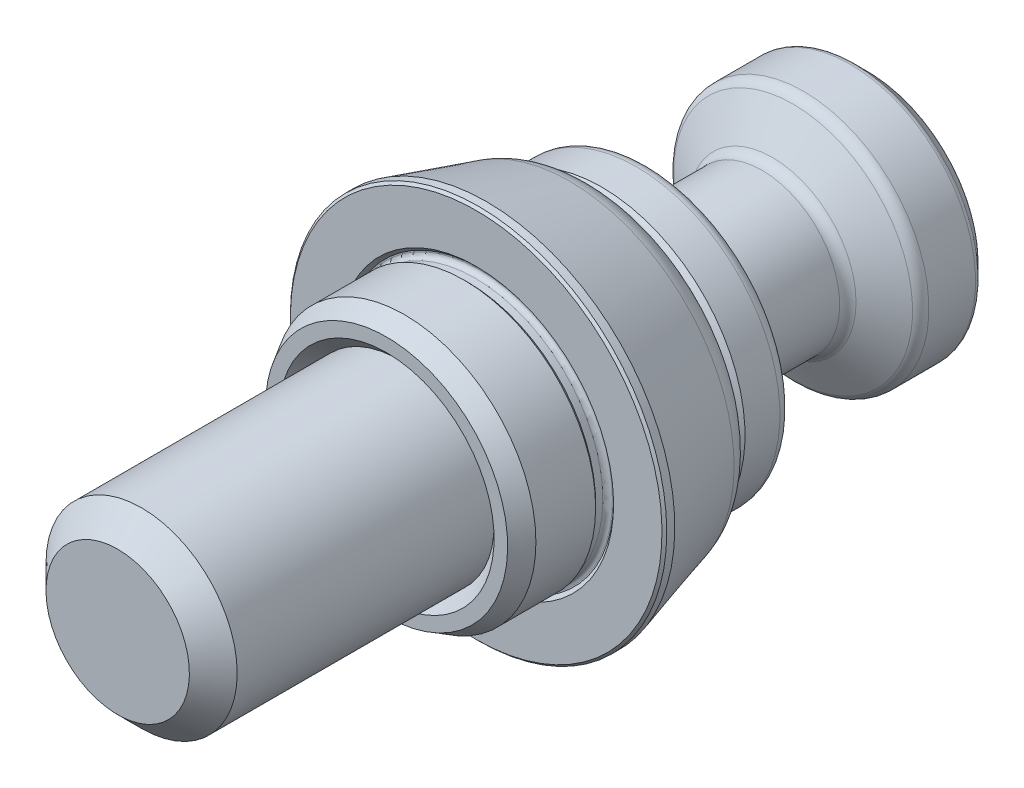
ISO-10303-21;
HEADER;
FILE_DESCRIPTION(('STEP AP214'),'2;1');
FILE_NAME('part.step','',(''),(''),'','','');
FILE_SCHEMA(('AUTOMOTIVE_DESIGN { 1 0 10303 214 1 1 1 1 }'));
ENDSEC;
DATA;
#1=APPLICATION_CONTEXT('core data for automotive mechanical design processes');
#2=APPLICATION_PROTOCOL_DEFINITION('international standard','automotive_design',2000,#1);
#3=PRODUCT_CONTEXT('',#1,'mechanical');
#4=PRODUCT('Part','Part','',(#3));
#5=PRODUCT_RELATED_PRODUCT_CATEGORY('part','',(#4));
#6=PRODUCT_DEFINITION_FORMATION('','',#4);
#7=PRODUCT_DEFINITION_CONTEXT('part definition',#1,'design');
#8=PRODUCT_DEFINITION('design','',#6,#7);
#9=PRODUCT_DEFINITION_SHAPE('','',#8);
#10=(LENGTH_UNIT() NAMED_UNIT(*) SI_UNIT(.MILLI.,.METRE.));
#11=(NAMED_UNIT(*) PLANE_ANGLE_UNIT() SI_UNIT($,.RADIAN.));
#12=(NAMED_UNIT(*) SI_UNIT($,.STERADIAN.) SOLID_ANGLE_UNIT());
#13=UNCERTAINTY_MEASURE_WITH_UNIT(LENGTH_MEASURE(1.E-05),#10,'distance_accuracy_value','');
#14=(GEOMETRIC_REPRESENTATION_CONTEXT(3) GLOBAL_UNCERTAINTY_ASSIGNED_CONTEXT((#13)) GLOBAL_UNIT_ASSIGNED_CONTEXT((#10,
#11,#12)) REPRESENTATION_CONTEXT('',''));
#15=CARTESIAN_POINT('',(0.,0.,0.));
#16=DIRECTION('',(0.,0.,1.));
#17=DIRECTION('',(1.,0.,0.));
#18=AXIS2_PLACEMENT_3D('',#15,#16,#17);
#19=CARTESIAN_POINT('',(0.,0.,7.5));
#20=DIRECTION('',(0.,0.,1.));
#21=DIRECTION('',(0.,-1.,0.));
#22=AXIS2_PLACEMENT_3D('',#19,#20,#21);
#23=CONICAL_SURFACE('',#22,9.,0.785398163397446);
#24=CARTESIAN_POINT('',(0.,0.,6.5));
#25=DIRECTION('',(0.,0.,1.));
#26=DIRECTION('',(0.,-1.,0.));
#27=AXIS2_PLACEMENT_3D('',#24,#25,#26);
#28=CIRCLE('',#27,8.);
#29=CARTESIAN_POINT('',(0.,-8.,6.5));
#30=VERTEX_POINT('',#29);
#31=EDGE_CURVE('E23',#30,#30,#28,.F.);
#32=ORIENTED_EDGE('',*,*,#31,.T.);
#33=EDGE_LOOP('',(#32));
#34=FACE_BOUND('',#33,.T.);
#35=CARTESIAN_POINT('',(0.,0.,7.5));
#36=DIRECTION('',(0.,0.,1.));
#37=DIRECTION('',(0.,-1.,0.));
#38=AXIS2_PLACEMENT_3D('',#35,#36,#37);
#39=CIRCLE('',#38,9.);
#40=CARTESIAN_POINT('',(0.,-9.,7.5));
#41=VERTEX_POINT('',#40);
#42=EDGE_CURVE('E178',#41,#41,#39,.F.);
#43=ORIENTED_EDGE('',*,*,#42,.F.);
#44=EDGE_LOOP('',(#43));
#45=FACE_BOUND('',#44,.T.);
#46=ADVANCED_FACE('F14',(#34,#45),#23,.F.);
#47=CARTESIAN_POINT('',(8.,0.,7.5));
#48=DIRECTION('',(0.,0.,1.));
#49=DIRECTION('',(0.,-1.,0.));
#50=AXIS2_PLACEMENT_3D('',#47,#48,#49);
#51=PLANE('',#50);
#52=ORIENTED_EDGE('',*,*,#42,.T.);
#53=EDGE_LOOP('',(#52));
#54=FACE_BOUND('',#53,.T.);
#55=CARTESIAN_POINT('',(0.,0.,7.5));
#56=DIRECTION('',(0.,0.,1.));
#57=DIRECTION('',(0.,-1.,0.));
#58=AXIS2_PLACEMENT_3D('',#55,#56,#57);
#59=CIRCLE('',#58,10.1339745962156);
#60=CARTESIAN_POINT('',(0.,-10.1339745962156,7.5));
#61=VERTEX_POINT('',#60);
#62=EDGE_CURVE('E175',#61,#61,#59,.T.);
#63=ORIENTED_EDGE('',*,*,#62,.T.);
#64=EDGE_LOOP('',(#63));
#65=FACE_BOUND('',#64,.T.);
#66=ADVANCED_FACE('F281',(#54,#65),#51,.T.);
#67=CARTESIAN_POINT('',(0.,0.,6.));
#68=DIRECTION('',(0.,0.,-1.));
#69=DIRECTION('',(0.,1.,0.));
#70=AXIS2_PLACEMENT_3D('',#67,#68,#69);
#71=CONICAL_SURFACE('',#70,11.,0.523598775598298);
#72=ORIENTED_EDGE('',*,*,#62,.F.);
#73=EDGE_LOOP('',(#72));
#74=FACE_BOUND('',#73,.T.);
#75=CARTESIAN_POINT('',(0.,0.,6.));
#76=DIRECTION('',(0.,0.,1.));
#77=DIRECTION('',(0.,-1.,0.));
#78=AXIS2_PLACEMENT_3D('',#75,#76,#77);
#79=CIRCLE('',#78,11.);
#80=CARTESIAN_POINT('',(0.,-11.,6.));
#81=VERTEX_POINT('',#80);
#82=EDGE_CURVE('E172',#81,#81,#79,.F.);
#83=ORIENTED_EDGE('',*,*,#82,.F.);
#84=EDGE_LOOP('',(#83));
#85=FACE_BOUND('',#84,.T.);
#86=ADVANCED_FACE('F282',(#74,#85),#71,.T.);
#87=CARTESIAN_POINT('',(0.,0.,0.));
#88=DIRECTION('',(0.,0.,-1.));
#89=DIRECTION('',(0.,1.,0.));
#90=AXIS2_PLACEMENT_3D('',#87,#88,#89);
#91=CYLINDRICAL_SURFACE('',#90,11.);
#92=CARTESIAN_POINT('',(0.,0.,1.));
#93=DIRECTION('',(0.,0.,-1.));
#94=DIRECTION('',(0.,1.,0.));
#95=AXIS2_PLACEMENT_3D('',#92,#93,#94);
#96=CIRCLE('',#95,11.);
#97=CARTESIAN_POINT('',(0.,11.,1.));
#98=VERTEX_POINT('',#97);
#99=EDGE_CURVE('E154',#98,#98,#96,.T.);
#100=ORIENTED_EDGE('',*,*,#99,.F.);
#101=EDGE_LOOP('',(#100));
#102=FACE_BOUND('',#101,.T.);
#103=ORIENTED_EDGE('',*,*,#82,.T.);
#104=EDGE_LOOP('',(#103));
#105=FACE_BOUND('',#104,.T.);
#106=ADVANCED_FACE('F287',(#102,#105),#91,.T.);
#107=CARTESIAN_POINT('',(0.,0.,1.));
#108=DIRECTION('',(0.,0.,1.));
#109=DIRECTION('',(0.,-1.,0.));
#110=AXIS2_PLACEMENT_3D('',#107,#108,#109);
#111=CONICAL_SURFACE('',#110,11.,0.78539816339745);
#112=CARTESIAN_POINT('',(0.,0.,0.7));
#113=DIRECTION('',(0.,0.,-1.));
#114=DIRECTION('',(0.,1.,0.));
#115=AXIS2_PLACEMENT_3D('',#112,#113,#114);
#116=CIRCLE('',#115,10.7);
#117=CARTESIAN_POINT('',(0.,10.7,0.7));
#118=VERTEX_POINT('',#117);
#119=EDGE_CURVE('E157',#118,#118,#116,.T.);
#120=ORIENTED_EDGE('',*,*,#119,.F.);
#121=EDGE_LOOP('',(#120));
#122=FACE_BOUND('',#121,.T.);
#123=ORIENTED_EDGE('',*,*,#99,.T.);
#124=EDGE_LOOP('',(#123));
#125=FACE_BOUND('',#124,.T.);
#126=ADVANCED_FACE('F272',(#122,#125),#111,.T.);
#127=CARTESIAN_POINT('',(0.,0.,0.));
#128=DIRECTION('',(0.,0.,-1.));
#129=DIRECTION('',(0.,1.,0.));
#130=AXIS2_PLACEMENT_3D('',#127,#128,#129);
#131=CYLINDRICAL_SURFACE('',#130,10.7);
#132=CARTESIAN_POINT('',(0.,0.,0.1));
#133=DIRECTION('',(0.,0.,-1.));
#134=DIRECTION('',(0.,1.,0.));
#135=AXIS2_PLACEMENT_3D('',#132,#133,#134);
#136=CIRCLE('',#135,10.7);
#137=CARTESIAN_POINT('',(0.,10.7,0.1));
#138=VERTEX_POINT('',#137);
#139=EDGE_CURVE('E18',#138,#138,#136,.F.);
#140=ORIENTED_EDGE('',*,*,#139,.T.);
#141=EDGE_LOOP('',(#140));
#142=FACE_BOUND('',#141,.T.);
#143=ORIENTED_EDGE('',*,*,#119,.T.);
#144=EDGE_LOOP('',(#143));
#145=FACE_BOUND('',#144,.T.);
#146=ADVANCED_FACE('F270',(#142,#145),#131,.T.);
#147=CARTESIAN_POINT('',(0.,0.,0.1));
#148=DIRECTION('',(0.,0.,-1.));
#149=DIRECTION('',(0.,1.,0.));
#150=AXIS2_PLACEMENT_3D('',#147,#148,#149);
#151=TOROIDAL_SURFACE('',#150,11.1,0.4);
#152=ORIENTED_EDGE('',*,*,#139,.F.);
#153=EDGE_LOOP('',(#152));
#154=FACE_BOUND('',#153,.T.);
#155=CARTESIAN_POINT('',(0.,0.,-0.3));
#156=DIRECTION('',(0.,0.,-1.));
#157=DIRECTION('',(0.,1.,0.));
#158=AXIS2_PLACEMENT_3D('',#155,#156,#157);
#159=CIRCLE('',#158,11.1);
#160=CARTESIAN_POINT('',(0.,11.1,-0.3));
#161=VERTEX_POINT('',#160);
#162=EDGE_CURVE('E186',#161,#161,#159,.T.);
#163=ORIENTED_EDGE('',*,*,#162,.F.);
#164=EDGE_LOOP('',(#163));
#165=FACE_BOUND('',#164,.T.);
#166=ADVANCED_FACE('F16',(#154,#165),#151,.F.);
#167=CARTESIAN_POINT('',(0.,0.,-7.));
#168=DIRECTION('',(0.,0.,-1.));
#169=DIRECTION('',(0.,1.,0.));
#170=AXIS2_PLACEMENT_3D('',#167,#168,#169);
#171=TOROIDAL_SURFACE('',#170,10.8718839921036,3.);
#172=CARTESIAN_POINT('',(0.,0.,-7.82691206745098));
#173=DIRECTION('',(0.,0.,-1.));
#174=DIRECTION('',(0.,1.,0.));
#175=AXIS2_PLACEMENT_3D('',#172,#173,#174);
#176=CIRCLE('',#175,13.7556690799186);
#177=CARTESIAN_POINT('',(0.,13.7556690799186,-7.82691206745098));
#178=VERTEX_POINT('',#177);
#179=EDGE_CURVE('E169',#178,#178,#176,.F.);
#180=ORIENTED_EDGE('',*,*,#179,.F.);
#181=EDGE_LOOP('',(#180));
#182=FACE_BOUND('',#181,.T.);
#183=CARTESIAN_POINT('',(0.,0.,-10.));
#184=DIRECTION('',(0.,0.,-1.));
#185=DIRECTION('',(0.,1.,0.));
#186=AXIS2_PLACEMENT_3D('',#183,#184,#185);
#187=CIRCLE('',#186,10.8718839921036);
#188=CARTESIAN_POINT('',(0.,10.8718839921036,-10.));
#189=VERTEX_POINT('',#188);
#190=EDGE_CURVE('E9',#189,#189,#187,.T.);
#191=ORIENTED_EDGE('',*,*,#190,.F.);
#192=EDGE_LOOP('',(#191));
#193=FACE_BOUND('',#192,.T.);
#194=ADVANCED_FACE('F269',(#182,#193),#171,.T.);
#195=CARTESIAN_POINT('',(0.,0.,-10.));
#196=DIRECTION('',(0.,0.,1.));
#197=DIRECTION('',(0.,-1.,0.));
#198=AXIS2_PLACEMENT_3D('',#195,#196,#197);
#199=CONICAL_SURFACE('',#198,13.132546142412,0.279252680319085);
#200=ORIENTED_EDGE('',*,*,#179,.T.);
#201=EDGE_LOOP('',(#200));
#202=FACE_BOUND('',#201,.T.);
#203=CARTESIAN_POINT('',(0.,0.,-0.871853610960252));
#204=DIRECTION('',(0.,0.,-1.));
#205=DIRECTION('',(0.,1.,0.));
#206=AXIS2_PLACEMENT_3D('',#203,#204,#205);
#207=CIRCLE('',#206,15.75);
#208=CARTESIAN_POINT('',(0.,15.75,-0.871853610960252));
#209=VERTEX_POINT('',#208);
#210=EDGE_CURVE('E166',#209,#209,#207,.T.);
#211=ORIENTED_EDGE('',*,*,#210,.T.);
#212=EDGE_LOOP('',(#211));
#213=FACE_BOUND('',#212,.T.);
#214=ADVANCED_FACE('F278',(#202,#213),#199,.T.);
#215=CARTESIAN_POINT('',(0.,0.,0.));
#216=DIRECTION('',(0.,0.,-1.));
#217=DIRECTION('',(0.,1.,0.));
#218=AXIS2_PLACEMENT_3D('',#215,#216,#217);
#219=CYLINDRICAL_SURFACE('',#218,15.75);
#220=CARTESIAN_POINT('',(0.,0.,-0.199999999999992));
#221=DIRECTION('',(0.,0.,1.));
#222=DIRECTION('',(0.,-1.,0.));
#223=AXIS2_PLACEMENT_3D('',#220,#221,#222);
#224=CIRCLE('',#223,15.75);
#225=CARTESIAN_POINT('',(0.,-15.75,-0.199999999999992));
#226=VERTEX_POINT('',#225);
#227=EDGE_CURVE('E181',#226,#226,#224,.F.);
#228=ORIENTED_EDGE('',*,*,#227,.T.);
#229=EDGE_LOOP('',(#228));
#230=FACE_BOUND('',#229,.T.);
#231=ORIENTED_EDGE('',*,*,#210,.F.);
#232=EDGE_LOOP('',(#231));
#233=FACE_BOUND('',#232,.T.);
#234=ADVANCED_FACE('F315',(#230,#233),#219,.T.);
#235=CARTESIAN_POINT('',(0.,0.,-0.199999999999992));
#236=DIRECTION('',(0.,0.,-1.));
#237=DIRECTION('',(0.,1.,0.));
#238=AXIS2_PLACEMENT_3D('',#235,#236,#237);
#239=CONICAL_SURFACE('',#238,15.75,0.785398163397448);
#240=CARTESIAN_POINT('',(0.,0.,0.));
#241=DIRECTION('',(0.,0.,1.));
#242=DIRECTION('',(0.,-1.,0.));
#243=AXIS2_PLACEMENT_3D('',#240,#241,#242);
#244=CIRCLE('',#243,15.55);
#245=CARTESIAN_POINT('',(0.,-15.55,0.));
#246=VERTEX_POINT('',#245);
#247=EDGE_CURVE('E184',#246,#246,#244,.T.);
#248=ORIENTED_EDGE('',*,*,#247,.F.);
#249=EDGE_LOOP('',(#248));
#250=FACE_BOUND('',#249,.T.);
#251=ORIENTED_EDGE('',*,*,#227,.F.);
#252=EDGE_LOOP('',(#251));
#253=FACE_BOUND('',#252,.T.);
#254=ADVANCED_FACE('F309',(#250,#253),#239,.T.);
#255=CARTESIAN_POINT('',(11.,0.,0.));
#256=DIRECTION('',(0.,0.,1.));
#257=DIRECTION('',(0.,-1.,0.));
#258=AXIS2_PLACEMENT_3D('',#255,#256,#257);
#259=PLANE('',#258);
#260=CARTESIAN_POINT('',(0.,0.,0.));
#261=DIRECTION('',(0.,0.,-1.));
#262=DIRECTION('',(0.,1.,0.));
#263=AXIS2_PLACEMENT_3D('',#260,#261,#262);
#264=CIRCLE('',#263,11.5);
#265=CARTESIAN_POINT('',(0.,11.5,0.));
#266=VERTEX_POINT('',#265);
#267=EDGE_CURVE('E163',#266,#266,#264,.T.);
#268=ORIENTED_EDGE('',*,*,#267,.T.);
#269=EDGE_LOOP('',(#268));
#270=FACE_BOUND('',#269,.T.);
#271=ORIENTED_EDGE('',*,*,#247,.T.);
#272=EDGE_LOOP('',(#271));
#273=FACE_BOUND('',#272,.T.);
#274=ADVANCED_FACE('F297',(#270,#273),#259,.T.);
#275=CARTESIAN_POINT('',(0.,0.,-0.3));
#276=DIRECTION('',(0.,0.,1.));
#277=DIRECTION('',(0.,-1.,0.));
#278=AXIS2_PLACEMENT_3D('',#275,#276,#277);
#279=CONICAL_SURFACE('',#278,11.2,0.785398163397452);
#280=ORIENTED_EDGE('',*,*,#267,.F.);
#281=EDGE_LOOP('',(#280));
#282=FACE_BOUND('',#281,.T.);
#283=CARTESIAN_POINT('',(0.,0.,-0.3));
#284=DIRECTION('',(0.,0.,-1.));
#285=DIRECTION('',(0.,1.,0.));
#286=AXIS2_PLACEMENT_3D('',#283,#284,#285);
#287=CIRCLE('',#286,11.2);
#288=CARTESIAN_POINT('',(0.,11.2,-0.3));
#289=VERTEX_POINT('',#288);
#290=EDGE_CURVE('E160',#289,#289,#287,.T.);
#291=ORIENTED_EDGE('',*,*,#290,.T.);
#292=EDGE_LOOP('',(#291));
#293=FACE_BOUND('',#292,.T.);
#294=ADVANCED_FACE('F305',(#282,#293),#279,.F.);
#295=CARTESIAN_POINT('',(10.7,0.,-0.3));
#296=DIRECTION('',(0.,0.,-1.));
#297=DIRECTION('',(0.,1.,0.));
#298=AXIS2_PLACEMENT_3D('',#295,#296,#297);
#299=PLANE('',#298);
#300=ORIENTED_EDGE('',*,*,#162,.T.);
#301=EDGE_LOOP('',(#300));
#302=FACE_BOUND('',#301,.T.);
#303=ORIENTED_EDGE('',*,*,#290,.F.);
#304=EDGE_LOOP('',(#303));
#305=FACE_BOUND('',#304,.T.);
#306=ADVANCED_FACE('F284',(#302,#305),#299,.F.);
#307=CARTESIAN_POINT('',(0.,0.,-10.));
#308=DIRECTION('',(0.,0.,-1.));
#309=DIRECTION('',(0.,-1.,0.));
#310=AXIS2_PLACEMENT_3D('',#307,#308,#309);
#311=CYLINDRICAL_SURFACE('',#310,8.);
#312=ORIENTED_EDGE('',*,*,#31,.F.);
#313=EDGE_LOOP('',(#312));
#314=FACE_BOUND('',#313,.T.);
#315=CARTESIAN_POINT('',(0.,0.,28.));
#316=DIRECTION('',(0.,0.,1.));
#317=DIRECTION('',(0.,1.,0.));
#318=AXIS2_PLACEMENT_3D('',#315,#316,#317);
#319=CIRCLE('',#318,8.);
#320=CARTESIAN_POINT('',(0.,8.,28.));
#321=VERTEX_POINT('',#320);
#322=EDGE_CURVE('E128',#321,#321,#319,.F.);
#323=ORIENTED_EDGE('',*,*,#322,.T.);
#324=EDGE_LOOP('',(#323));
#325=FACE_BOUND('',#324,.T.);
#326=ADVANCED_FACE('F304',(#314,#325),#311,.T.);
#327=CARTESIAN_POINT('',(0.,0.,28.));
#328=DIRECTION('',(0.,0.,-1.));
#329=DIRECTION('',(0.,-1.,0.));
#330=AXIS2_PLACEMENT_3D('',#327,#328,#329);
#331=CONICAL_SURFACE('',#330,8.,0.78539816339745);
#332=CARTESIAN_POINT('',(0.,0.,30.));
#333=DIRECTION('',(0.,0.,1.));
#334=DIRECTION('',(0.,1.,0.));
#335=AXIS2_PLACEMENT_3D('',#332,#333,#334);
#336=CIRCLE('',#335,6.);
#337=CARTESIAN_POINT('',(0.,6.,30.));
#338=VERTEX_POINT('',#337);
#339=EDGE_CURVE('E131',#338,#338,#336,.T.);
#340=ORIENTED_EDGE('',*,*,#339,.F.);
#341=EDGE_LOOP('',(#340));
#342=FACE_BOUND('',#341,.T.);
#343=ORIENTED_EDGE('',*,*,#322,.F.);
#344=EDGE_LOOP('',(#343));
#345=FACE_BOUND('',#344,.T.);
#346=ADVANCED_FACE('F372',(#342,#345),#331,.T.);
#347=CARTESIAN_POINT('',(0.,0.,30.));
#348=DIRECTION('',(0.,0.,1.));
#349=DIRECTION('',(0.,1.,0.));
#350=AXIS2_PLACEMENT_3D('',#347,#348,#349);
#351=PLANE('',#350);
#352=ORIENTED_EDGE('',*,*,#339,.T.);
#353=EDGE_LOOP('',(#352));
#354=FACE_BOUND('',#353,.T.);
#355=ADVANCED_FACE('F296',(#354),#351,.T.);
#356=CARTESIAN_POINT('',(0.,0.,-27.3867513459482));
#357=DIRECTION('',(0.,0.,-1.));
#358=DIRECTION('',(0.,-1.,0.));
#359=AXIS2_PLACEMENT_3D('',#356,#357,#358);
#360=TOROIDAL_SURFACE('',#359,9.5,1.);
#361=CARTESIAN_POINT('',(0.,0.,-27.3867513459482));
#362=DIRECTION('',(0.,0.,-1.));
#363=DIRECTION('',(0.,-1.,0.));
#364=AXIS2_PLACEMENT_3D('',#361,#362,#363);
#365=CIRCLE('',#364,10.5);
#366=CARTESIAN_POINT('',(0.,-10.5,-27.3867513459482));
#367=VERTEX_POINT('',#366);
#368=EDGE_CURVE('E149',#367,#367,#365,.T.);
#369=ORIENTED_EDGE('',*,*,#368,.F.);
#370=EDGE_LOOP('',(#369));
#371=FACE_BOUND('',#370,.T.);
#372=CARTESIAN_POINT('',(0.,0.,-26.5207259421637));
#373=DIRECTION('',(0.,0.,1.));
#374=DIRECTION('',(0.,1.,0.));
#375=AXIS2_PLACEMENT_3D('',#372,#373,#374);
#376=CIRCLE('',#375,10.);
#377=CARTESIAN_POINT('',(0.,10.,-26.5207259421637));
#378=VERTEX_POINT('',#377);
#379=EDGE_CURVE('E146',#378,#378,#376,.T.);
#380=ORIENTED_EDGE('',*,*,#379,.F.);
#381=EDGE_LOOP('',(#380));
#382=FACE_BOUND('',#381,.T.);
#383=ADVANCED_FACE('F265',(#371,#382),#360,.T.);
#384=CARTESIAN_POINT('',(0.,0.,-13.4226497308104));
#385=DIRECTION('',(0.,0.,-1.));
#386=DIRECTION('',(0.,-1.,0.));
#387=AXIS2_PLACEMENT_3D('',#384,#385,#386);
#388=TOROIDAL_SURFACE('',#387,11.,1.);
#389=CARTESIAN_POINT('',(0.,0.,-14.2886751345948));
#390=DIRECTION('',(0.,0.,-1.));
#391=DIRECTION('',(0.,-1.,0.));
#392=AXIS2_PLACEMENT_3D('',#389,#390,#391);
#393=CIRCLE('',#392,11.5);
#394=CARTESIAN_POINT('',(0.,-11.5,-14.2886751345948));
#395=VERTEX_POINT('',#394);
#396=EDGE_CURVE('E143',#395,#395,#393,.T.);
#397=ORIENTED_EDGE('',*,*,#396,.F.);
#398=EDGE_LOOP('',(#397));
#399=FACE_BOUND('',#398,.T.);
#400=CARTESIAN_POINT('',(0.,0.,-13.4226497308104));
#401=DIRECTION('',(0.,0.,-1.));
#402=DIRECTION('',(0.,-1.,0.));
#403=AXIS2_PLACEMENT_3D('',#400,#401,#402);
#404=CIRCLE('',#403,12.);
#405=CARTESIAN_POINT('',(0.,-12.,-13.4226497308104));
#406=VERTEX_POINT('',#405);
#407=EDGE_CURVE('E140',#406,#406,#404,.F.);
#408=ORIENTED_EDGE('',*,*,#407,.F.);
#409=EDGE_LOOP('',(#408));
#410=FACE_BOUND('',#409,.T.);
#411=ADVANCED_FACE('F258',(#399,#410),#388,.T.);
#412=CARTESIAN_POINT('',(-3.46410161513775,0.,-28.5));
#413=DIRECTION('',(-0.866025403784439,0.5,0.));
#414=DIRECTION('',(-0.5,-0.866025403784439,0.));
#415=AXIS2_PLACEMENT_3D('',#412,#413,#414);
#416=PLANE('',#415);
#417=CARTESIAN_POINT('',(-1.73193533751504,3.0002,-32.8350031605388));
#418=CARTESIAN_POINT('',(-1.80805042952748,2.86836479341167,-32.7910410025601));
#419=CARTESIAN_POINT('',(-1.88482254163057,2.73539159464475,-32.7510588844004));
#420=CARTESIAN_POINT('',(-2.03969618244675,2.46714257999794,-32.6812693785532));
#421=CARTESIAN_POINT('',(-2.11780046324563,2.33186199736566,-32.6514866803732));
#422=CARTESIAN_POINT('',(-2.27304105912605,2.06297739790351,-32.605125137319));
#423=CARTESIAN_POINT('',(-2.35015348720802,1.92941475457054,-32.5882377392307));
#424=CARTESIAN_POINT('',(-2.50474122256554,1.66166094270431,-32.5680769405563));
#425=CARTESIAN_POINT('',(-2.58221596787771,1.52747074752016,-32.5647868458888));
#426=CARTESIAN_POINT('',(-2.72698443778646,1.27672440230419,-32.5716278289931));
#427=CARTESIAN_POINT('',(-2.79429982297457,1.16013073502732,-32.5800792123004));
#428=CARTESIAN_POINT('',(-2.92849202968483,0.927703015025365,-32.6068662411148));
#429=CARTESIAN_POINT('',(-2.99536838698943,0.81186976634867,-32.6252110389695));
#430=CARTESIAN_POINT('',(-3.12983731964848,0.578962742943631,-32.6710720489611));
#431=CARTESIAN_POINT('',(-3.19741287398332,0.461918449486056,-32.6987826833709));
#432=CARTESIAN_POINT('',(-3.33155605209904,0.229575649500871,-32.7616750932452));
#433=CARTESIAN_POINT('',(-3.39812539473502,0.114274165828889,-32.7968420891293));
#434=CARTESIAN_POINT('',(-3.4642170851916,-0.000200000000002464,-32.8350031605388));
#435=B_SPLINE_CURVE_WITH_KNOTS('',3,(#417,#418,#419,#420,#421,#422,#423,#424,#425,#426,#427,
#428,#429,#430,#431,#432,#433,#434),.UNSPECIFIED.,.F.,.F.,(4,2,2,2,2,2,2,2,4),(0.,
0.475539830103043,0.952222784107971,1.41710776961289,1.88142182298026,2.28572436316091,
2.69040156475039,3.10405572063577,3.51689749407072),.UNSPECIFIED.);
#436=CARTESIAN_POINT('',(-1.73205080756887,3.,-32.8349364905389));
#437=VERTEX_POINT('',#436);
#438=CARTESIAN_POINT('',(-3.46410161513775,0.,-32.8349364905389));
#439=VERTEX_POINT('',#438);
#440=EDGE_CURVE('E31',#437,#439,#435,.T.);
#441=ORIENTED_EDGE('',*,*,#440,.F.);
#442=DIRECTION('',(0.,0.,-1.));
#443=VECTOR('',#442,1.);
#444=CARTESIAN_POINT('',(-1.73205080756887,3.,-28.5));
#445=LINE('',#444,#443);
#446=CARTESIAN_POINT('',(-1.73205080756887,3.,-28.5));
#447=VERTEX_POINT('',#446);
#448=EDGE_CURVE('E103',#447,#437,#445,.T.);
#449=ORIENTED_EDGE('',*,*,#448,.F.);
#450=DIRECTION('',(0.5,0.866025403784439,0.));
#451=VECTOR('',#450,1.);
#452=CARTESIAN_POINT('',(-3.46410161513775,0.,-28.5));
#453=LINE('',#452,#451);
#454=CARTESIAN_POINT('',(-3.46410161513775,0.,-28.5));
#455=VERTEX_POINT('',#454);
#456=EDGE_CURVE('E650',#455,#447,#453,.T.);
#457=ORIENTED_EDGE('',*,*,#456,.F.);
#458=DIRECTION('',(0.,0.,-1.));
#459=VECTOR('',#458,1.);
#460=CARTESIAN_POINT('',(-3.46410161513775,0.,-28.5));
#461=LINE('',#460,#459);
#462=EDGE_CURVE('E106',#455,#439,#461,.T.);
#463=ORIENTED_EDGE('',*,*,#462,.T.);
#464=EDGE_LOOP('',(#441,#449,#457,#463));
#465=FACE_BOUND('',#464,.T.);
#466=ADVANCED_FACE('F253',(#465),#416,.F.);
#467=CARTESIAN_POINT('',(-1.73205080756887,3.,-28.5));
#468=DIRECTION('',(0.,1.,0.));
#469=DIRECTION('',(-1.,0.,0.));
#470=AXIS2_PLACEMENT_3D('',#467,#468,#469);
#471=PLANE('',#470);
#472=CARTESIAN_POINT('',(4.57816394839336,3.,-33.9950833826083));
#473=CARTESIAN_POINT('',(4.44770534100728,3.,-33.9321019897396));
#474=CARTESIAN_POINT('',(4.31693905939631,3.,-33.8697465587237));
#475=CARTESIAN_POINT('',(4.05462715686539,3.,-33.7466413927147));
#476=CARTESIAN_POINT('',(3.92308140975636,3.,-33.6858919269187));
#477=CARTESIAN_POINT('',(3.65833272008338,3.,-33.5660308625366));
#478=CARTESIAN_POINT('',(3.52512459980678,3.,-33.5069306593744));
#479=CARTESIAN_POINT('',(3.25762204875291,3.,-33.3912515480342));
#480=CARTESIAN_POINT('',(3.12332767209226,3.,-33.3346725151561));
#481=CARTESIAN_POINT('',(2.84947160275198,3.,-33.2230876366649));
#482=CARTESIAN_POINT('',(2.70987100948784,3.,-33.168176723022));
#483=CARTESIAN_POINT('',(2.42900957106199,3.,-33.0626937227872));
#484=CARTESIAN_POINT('',(2.28774853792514,3.,-33.0121221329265));
#485=CARTESIAN_POINT('',(2.00363062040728,3.,-32.9166996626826));
#486=CARTESIAN_POINT('',(1.86077789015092,3.,-32.871836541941));
#487=CARTESIAN_POINT('',(1.5730258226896,3.,-32.789318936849));
#488=CARTESIAN_POINT('',(1.4281271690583,3.,-32.7516621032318));
#489=CARTESIAN_POINT('',(1.13695389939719,3.,-32.6855990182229));
#490=CARTESIAN_POINT('',(0.990689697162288,3.,-32.657147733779));
#491=CARTESIAN_POINT('',(0.696423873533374,3.,-32.6111671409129));
#492=CARTESIAN_POINT('',(0.548422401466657,3.,-32.5936369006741));
#493=CARTESIAN_POINT('',(0.253322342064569,3.,-32.5711271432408));
#494=CARTESIAN_POINT('',(0.106235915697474,3.,-32.5659920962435));
#495=CARTESIAN_POINT('',(-0.18784914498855,3.,-32.568302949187));
#496=CARTESIAN_POINT('',(-0.334847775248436,3.,-32.5757493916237));
#497=CARTESIAN_POINT('',(-0.586621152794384,3.,-32.5987632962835));
#498=CARTESIAN_POINT('',(-0.691671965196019,3.,-32.6114663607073));
#499=CARTESIAN_POINT('',(-0.900950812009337,3.,-32.6424661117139));
#500=CARTESIAN_POINT('',(-1.00517872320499,3.,-32.6607636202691));
#501=CARTESIAN_POINT('',(-1.316515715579,3.,-32.7230802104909));
#502=CARTESIAN_POINT('',(-1.52215497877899,3.,-32.7745106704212));
#503=CARTESIAN_POINT('',(-1.82965945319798,3.,-32.8630327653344));
#504=CARTESIAN_POINT('',(-1.93313257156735,3.,-32.8948509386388));
#505=CARTESIAN_POINT('',(-2.13907223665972,3.,-32.9616217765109));
#506=CARTESIAN_POINT('',(-2.24153877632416,3.,-32.9965744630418));
#507=CARTESIAN_POINT('',(-2.44550231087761,3.,-33.0690674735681));
#508=CARTESIAN_POINT('',(-2.54699964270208,3.,-33.1066068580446));
#509=CARTESIAN_POINT('',(-2.74916366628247,3.,-33.1838485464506));
#510=CARTESIAN_POINT('',(-2.84983037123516,3.,-33.2235508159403));
#511=CARTESIAN_POINT('',(-3.1028586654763,3.,-33.325976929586));
#512=CARTESIAN_POINT('',(-3.25473921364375,3.,-33.3898874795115));
#513=CARTESIAN_POINT('',(-3.5571231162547,3.,-33.5208972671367));
#514=CARTESIAN_POINT('',(-3.70762636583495,3.,-33.587996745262));
#515=CARTESIAN_POINT('',(-4.00754037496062,3.,-33.7246828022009));
#516=CARTESIAN_POINT('',(-4.15695085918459,3.,-33.7942699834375));
#517=CARTESIAN_POINT('',(-4.45485069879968,3.,-33.9353919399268));
#518=CARTESIAN_POINT('',(-4.60334003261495,3.,-34.0069267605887));
#519=CARTESIAN_POINT('',(-5.04803783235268,3.,-34.224009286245));
#520=CARTESIAN_POINT('',(-5.34311674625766,3.,-34.3718687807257));
#521=CARTESIAN_POINT('',(-5.93116502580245,3.,-34.6715928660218));
#522=CARTESIAN_POINT('',(-6.22413469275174,3.,-34.823456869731));
#523=CARTESIAN_POINT('',(-6.78142028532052,3.,-35.1157233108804));
#524=CARTESIAN_POINT('',(-7.0458664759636,3.,-35.2558777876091));
#525=CARTESIAN_POINT('',(-7.57386151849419,3.,-35.5378914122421));
#526=CARTESIAN_POINT('',(-7.83741033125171,3.,-35.67975063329));
#527=CARTESIAN_POINT('',(-8.36311374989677,3.,-35.9643722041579));
#528=CARTESIAN_POINT('',(-8.62527019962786,3.,-36.1071311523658));
#529=CARTESIAN_POINT('',(-9.14901852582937,3.,-36.3936442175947));
#530=CARTESIAN_POINT('',(-9.4106104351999,3.,-36.5373982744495));
#531=CARTESIAN_POINT('',(-9.67199904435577,3.,-36.6815185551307));
#532=B_SPLINE_CURVE_WITH_KNOTS('',3,(#472,#473,#474,#475,#476,#477,#478,#479,#480,#481,#482,
#483,#484,#485,#486,#487,#488,#489,#490,#491,#492,#493,#494,#495,#496,#497,#498,#499,#500,#501,
#502,#503,#504,#505,#506,#507,#508,#509,#510,#511,#512,#513,#514,#515,#516,#517,#518,#519,#520,
#521,#522,#523,#524,#525,#526,#527,#528,#529,#530,#531),.UNSPECIFIED.,.F.,.F.,(4,2,2,2,2,2,2,2,
2,2,2,2,2,2,2,2,2,2,2,2,2,2,2,2,2,2,2,2,2,4),(0.,0.434603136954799,0.869278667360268,
1.3064478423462,1.74359537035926,2.19357500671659,2.64360608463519,3.09265531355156,
3.54155790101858,3.98823005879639,4.4348640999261,4.87586414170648,5.31688319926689,
5.63417619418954,5.95151583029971,6.58656462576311,6.91130347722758,7.23604460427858,
7.56066839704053,7.88528702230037,8.37957333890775,8.87389698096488,9.36834115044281,
9.86279685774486,10.8528958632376,11.842850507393,12.7407149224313,13.6386179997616,
14.5341350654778,15.4295984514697),.UNSPECIFIED.);
#533=CARTESIAN_POINT('',(1.73205080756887,3.,-32.8349364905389));
#534=VERTEX_POINT('',#533);
#535=EDGE_CURVE('E238',#534,#437,#532,.T.);
#536=ORIENTED_EDGE('',*,*,#535,.F.);
#537=DIRECTION('',(0.,0.,-1.));
#538=VECTOR('',#537,1.);
#539=CARTESIAN_POINT('',(1.73205080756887,3.,-28.5));
#540=LINE('',#539,#538);
#541=CARTESIAN_POINT('',(1.73205080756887,3.,-28.5));
#542=VERTEX_POINT('',#541);
#543=EDGE_CURVE('E100',#542,#534,#540,.T.);
#544=ORIENTED_EDGE('',*,*,#543,.F.);
#545=DIRECTION('',(1.,0.,0.));
#546=VECTOR('',#545,1.);
#547=CARTESIAN_POINT('',(-1.73205080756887,3.,-28.5));
#548=LINE('',#547,#546);
#549=EDGE_CURVE('E648',#447,#542,#548,.T.);
#550=ORIENTED_EDGE('',*,*,#549,.F.);
#551=ORIENTED_EDGE('',*,*,#448,.T.);
#552=EDGE_LOOP('',(#536,#544,#550,#551));
#553=FACE_BOUND('',#552,.T.);
#554=ADVANCED_FACE('F249',(#553),#471,.F.);
#555=CARTESIAN_POINT('',(1.73205080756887,3.,-28.5));
#556=DIRECTION('',(0.866025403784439,0.5,0.));
#557=DIRECTION('',(-0.5,0.866025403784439,0.));
#558=AXIS2_PLACEMENT_3D('',#555,#556,#557);
#559=PLANE('',#558);
#560=CARTESIAN_POINT('',(3.4642170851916,-0.000199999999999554,-32.8350031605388));
#561=CARTESIAN_POINT('',(3.38810199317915,0.13163520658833,-32.7910410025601));
#562=CARTESIAN_POINT('',(3.31132988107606,0.264608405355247,-32.7510588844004));
#563=CARTESIAN_POINT('',(3.15645624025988,0.532857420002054,-32.6812693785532));
#564=CARTESIAN_POINT('',(3.078351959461,0.668138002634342,-32.6514866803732));
#565=CARTESIAN_POINT('',(2.92311136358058,0.937022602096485,-32.605125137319));
#566=CARTESIAN_POINT('',(2.84599893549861,1.07058524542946,-32.5882377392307));
#567=CARTESIAN_POINT('',(2.69141120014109,1.33833905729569,-32.5680769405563));
#568=CARTESIAN_POINT('',(2.61393645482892,1.47252925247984,-32.5647868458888));
#569=CARTESIAN_POINT('',(2.46916798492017,1.72327559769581,-32.5716278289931));
#570=CARTESIAN_POINT('',(2.40185259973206,1.83986926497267,-32.5800792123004));
#571=CARTESIAN_POINT('',(2.2676603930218,2.07229698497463,-32.6068662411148));
#572=CARTESIAN_POINT('',(2.2007840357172,2.18813023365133,-32.6252110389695));
#573=CARTESIAN_POINT('',(2.06631510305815,2.42103725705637,-32.6710720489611));
#574=CARTESIAN_POINT('',(1.99873954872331,2.53808155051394,-32.6987826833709));
#575=CARTESIAN_POINT('',(1.86459637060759,2.77042435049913,-32.7616750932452));
#576=CARTESIAN_POINT('',(1.79802702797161,2.88572583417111,-32.7968420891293));
#577=CARTESIAN_POINT('',(1.73193533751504,3.0002,-32.8350031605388));
#578=B_SPLINE_CURVE_WITH_KNOTS('',3,(#560,#561,#562,#563,#564,#565,#566,#567,#568,#569,#570,
#571,#572,#573,#574,#575,#576,#577),.UNSPECIFIED.,.F.,.F.,(4,2,2,2,2,2,2,2,4),(0.,
0.475539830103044,0.952222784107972,1.41710776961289,1.88142182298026,2.28572436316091,
2.69040156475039,3.10405572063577,3.51689749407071),.UNSPECIFIED.);
#579=CARTESIAN_POINT('',(3.46410161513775,0.,-32.8349364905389));
#580=VERTEX_POINT('',#579);
#581=EDGE_CURVE('E231',#580,#534,#578,.T.);
#582=ORIENTED_EDGE('',*,*,#581,.F.);
#583=DIRECTION('',(0.,0.,-1.));
#584=VECTOR('',#583,1.);
#585=CARTESIAN_POINT('',(3.46410161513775,0.,-28.5));
#586=LINE('',#585,#584);
#587=CARTESIAN_POINT('',(3.46410161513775,0.,-28.5));
#588=VERTEX_POINT('',#587);
#589=EDGE_CURVE('E93',#588,#580,#586,.T.);
#590=ORIENTED_EDGE('',*,*,#589,.F.);
#591=DIRECTION('',(0.5,-0.866025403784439,0.));
#592=VECTOR('',#591,1.);
#593=CARTESIAN_POINT('',(1.73205080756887,3.,-28.5));
#594=LINE('',#593,#592);
#595=EDGE_CURVE('E646',#542,#588,#594,.T.);
#596=ORIENTED_EDGE('',*,*,#595,.F.);
#597=ORIENTED_EDGE('',*,*,#543,.T.);
#598=EDGE_LOOP('',(#582,#590,#596,#597));
#599=FACE_BOUND('',#598,.T.);
#600=ADVANCED_FACE('F252',(#599),#559,.F.);
#601=CARTESIAN_POINT('',(3.46410161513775,0.,-28.5));
#602=DIRECTION('',(0.866025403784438,-0.5,0.));
#603=DIRECTION('',(0.5,0.866025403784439,0.));
#604=AXIS2_PLACEMENT_3D('',#601,#602,#603);
#605=PLANE('',#604);
#606=CARTESIAN_POINT('',(1.73193533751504,-3.0002,-32.8350031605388));
#607=CARTESIAN_POINT('',(1.80805042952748,-2.86836479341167,-32.7910410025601));
#608=CARTESIAN_POINT('',(1.88482254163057,-2.73539159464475,-32.7510588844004));
#609=CARTESIAN_POINT('',(2.03969618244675,-2.46714257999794,-32.6812693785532));
#610=CARTESIAN_POINT('',(2.11780046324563,-2.33186199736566,-32.6514866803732));
#611=CARTESIAN_POINT('',(2.27304105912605,-2.06297739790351,-32.605125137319));
#612=CARTESIAN_POINT('',(2.35015348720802,-1.92941475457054,-32.5882377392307));
#613=CARTESIAN_POINT('',(2.50474122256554,-1.66166094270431,-32.5680769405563));
#614=CARTESIAN_POINT('',(2.58221596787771,-1.52747074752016,-32.5647868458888));
#615=CARTESIAN_POINT('',(2.72698443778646,-1.27672440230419,-32.5716278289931));
#616=CARTESIAN_POINT('',(2.79429982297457,-1.16013073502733,-32.5800792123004));
#617=CARTESIAN_POINT('',(2.92849202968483,-0.927703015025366,-32.6068662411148));
#618=CARTESIAN_POINT('',(2.99536838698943,-0.811869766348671,-32.6252110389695));
#619=CARTESIAN_POINT('',(3.12983731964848,-0.578962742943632,-32.6710720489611));
#620=CARTESIAN_POINT('',(3.19741287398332,-0.461918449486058,-32.6987826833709));
#621=CARTESIAN_POINT('',(3.33155605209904,-0.229575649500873,-32.7616750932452));
#622=CARTESIAN_POINT('',(3.39812539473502,-0.114274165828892,-32.7968420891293));
#623=CARTESIAN_POINT('',(3.4642170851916,0.000200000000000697,-32.8350031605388));
#624=B_SPLINE_CURVE_WITH_KNOTS('',3,(#606,#607,#608,#609,#610,#611,#612,#613,#614,#615,#616,
#617,#618,#619,#620,#621,#622,#623),.UNSPECIFIED.,.F.,.F.,(4,2,2,2,2,2,2,2,4),(0.,
0.475539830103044,0.952222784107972,1.41710776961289,1.88142182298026,2.28572436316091,
2.69040156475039,3.10405572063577,3.51689749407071),.UNSPECIFIED.);
#625=CARTESIAN_POINT('',(1.73205080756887,-3.,-32.8349364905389));
#626=VERTEX_POINT('',#625);
#627=EDGE_CURVE('E84',#626,#580,#624,.T.);
#628=ORIENTED_EDGE('',*,*,#627,.F.);
#629=DIRECTION('',(0.,0.,-1.));
#630=VECTOR('',#629,1.);
#631=CARTESIAN_POINT('',(1.73205080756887,-3.,-28.5));
#632=LINE('',#631,#630);
#633=CARTESIAN_POINT('',(1.73205080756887,-3.,-28.5));
#634=VERTEX_POINT('',#633);
#635=EDGE_CURVE('E83',#634,#626,#632,.T.);
#636=ORIENTED_EDGE('',*,*,#635,.F.);
#637=DIRECTION('',(-0.5,-0.866025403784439,0.));
#638=VECTOR('',#637,1.);
#639=CARTESIAN_POINT('',(3.46410161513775,0.,-28.5));
#640=LINE('',#639,#638);
#641=EDGE_CURVE('E647',#588,#634,#640,.T.);
#642=ORIENTED_EDGE('',*,*,#641,.F.);
#643=ORIENTED_EDGE('',*,*,#589,.T.);
#644=EDGE_LOOP('',(#628,#636,#642,#643));
#645=FACE_BOUND('',#644,.T.);
#646=ADVANCED_FACE('F630',(#645),#605,.F.);
#647=CARTESIAN_POINT('',(1.73205080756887,-3.,-28.5));
#648=DIRECTION('',(0.,-1.,0.));
#649=DIRECTION('',(1.,0.,0.));
#650=AXIS2_PLACEMENT_3D('',#647,#648,#649);
#651=PLANE('',#650);
#652=CARTESIAN_POINT('',(4.57816394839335,-3.,-33.9950833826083));
#653=CARTESIAN_POINT('',(4.44770534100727,-3.,-33.9321019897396));
#654=CARTESIAN_POINT('',(4.3169390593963,-3.,-33.8697465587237));
#655=CARTESIAN_POINT('',(4.05462715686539,-3.,-33.7466413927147));
#656=CARTESIAN_POINT('',(3.92308140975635,-3.,-33.6858919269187));
#657=CARTESIAN_POINT('',(3.65833272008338,-3.,-33.5660308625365));
#658=CARTESIAN_POINT('',(3.52512459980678,-3.,-33.5069306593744));
#659=CARTESIAN_POINT('',(3.2576220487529,-3.,-33.3912515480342));
#660=CARTESIAN_POINT('',(3.12332767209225,-3.,-33.3346725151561));
#661=CARTESIAN_POINT('',(2.84947160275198,-3.,-33.2230876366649));
#662=CARTESIAN_POINT('',(2.70987100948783,-3.,-33.168176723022));
#663=CARTESIAN_POINT('',(2.42900957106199,-3.,-33.0626937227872));
#664=CARTESIAN_POINT('',(2.28774853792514,-3.,-33.0121221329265));
#665=CARTESIAN_POINT('',(2.00363062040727,-3.,-32.9166996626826));
#666=CARTESIAN_POINT('',(1.86077789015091,-3.,-32.871836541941));
#667=CARTESIAN_POINT('',(1.57302582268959,-3.,-32.789318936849));
#668=CARTESIAN_POINT('',(1.4281271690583,-3.,-32.7516621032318));
#669=CARTESIAN_POINT('',(1.13695389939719,-3.,-32.6855990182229));
#670=CARTESIAN_POINT('',(0.990689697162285,-3.,-32.657147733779));
#671=CARTESIAN_POINT('',(0.696423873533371,-3.,-32.6111671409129));
#672=CARTESIAN_POINT('',(0.548422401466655,-3.,-32.5936369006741));
#673=CARTESIAN_POINT('',(0.253322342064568,-3.,-32.5711271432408));
#674=CARTESIAN_POINT('',(0.106235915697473,-3.,-32.5659920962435));
#675=CARTESIAN_POINT('',(-0.187849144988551,-3.,-32.568302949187));
#676=CARTESIAN_POINT('',(-0.334847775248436,-3.,-32.5757493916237));
#677=CARTESIAN_POINT('',(-0.586621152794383,-3.,-32.5987632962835));
#678=CARTESIAN_POINT('',(-0.691671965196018,-3.,-32.6114663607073));
#679=CARTESIAN_POINT('',(-0.900950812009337,-3.,-32.6424661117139));
#680=CARTESIAN_POINT('',(-1.00517872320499,-3.,-32.6607636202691));
#681=CARTESIAN_POINT('',(-1.316515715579,-3.,-32.7230802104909));
#682=CARTESIAN_POINT('',(-1.52215497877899,-3.,-32.7745106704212));
#683=CARTESIAN_POINT('',(-1.82965945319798,-3.,-32.8630327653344));
#684=CARTESIAN_POINT('',(-1.93313257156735,-3.,-32.8948509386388));
#685=CARTESIAN_POINT('',(-2.13907223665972,-3.,-32.9616217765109));
#686=CARTESIAN_POINT('',(-2.24153877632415,-3.,-32.9965744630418));
#687=CARTESIAN_POINT('',(-2.4455023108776,-3.,-33.0690674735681));
#688=CARTESIAN_POINT('',(-2.54699964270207,-3.,-33.1066068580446));
#689=CARTESIAN_POINT('',(-2.74916366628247,-3.,-33.1838485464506));
#690=CARTESIAN_POINT('',(-2.84983037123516,-3.,-33.2235508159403));
#691=CARTESIAN_POINT('',(-3.10285866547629,-3.,-33.325976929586));
#692=CARTESIAN_POINT('',(-3.25473921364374,-3.,-33.3898874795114));
#693=CARTESIAN_POINT('',(-3.55712311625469,-3.,-33.5208972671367));
#694=CARTESIAN_POINT('',(-3.70762636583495,-3.,-33.587996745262));
#695=CARTESIAN_POINT('',(-4.00754037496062,-3.,-33.7246828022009));
#696=CARTESIAN_POINT('',(-4.15695085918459,-3.,-33.7942699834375));
#697=CARTESIAN_POINT('',(-4.45485069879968,-3.,-33.9353919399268));
#698=CARTESIAN_POINT('',(-4.60334003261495,-3.,-34.0069267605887));
#699=CARTESIAN_POINT('',(-5.04803783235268,-3.,-34.224009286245));
#700=CARTESIAN_POINT('',(-5.34311674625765,-3.,-34.3718687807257));
#701=CARTESIAN_POINT('',(-5.93116502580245,-3.,-34.6715928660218));
#702=CARTESIAN_POINT('',(-6.22413469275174,-3.,-34.823456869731));
#703=CARTESIAN_POINT('',(-6.78142028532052,-3.,-35.1157233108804));
#704=CARTESIAN_POINT('',(-7.0458664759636,-3.,-35.2558777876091));
#705=CARTESIAN_POINT('',(-7.57386151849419,-3.,-35.5378914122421));
#706=CARTESIAN_POINT('',(-7.83741033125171,-3.,-35.67975063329));
#707=CARTESIAN_POINT('',(-8.36311374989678,-3.,-35.9643722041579));
#708=CARTESIAN_POINT('',(-8.62527019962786,-3.,-36.1071311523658));
#709=CARTESIAN_POINT('',(-9.14901852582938,-3.,-36.3936442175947));
#710=CARTESIAN_POINT('',(-9.4106104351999,-3.,-36.5373982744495));
#711=CARTESIAN_POINT('',(-9.67199904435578,-3.,-36.6815185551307));
#712=B_SPLINE_CURVE_WITH_KNOTS('',3,(#652,#653,#654,#655,#656,#657,#658,#659,#660,#661,#662,
#663,#664,#665,#666,#667,#668,#669,#670,#671,#672,#673,#674,#675,#676,#677,#678,#679,#680,#681,
#682,#683,#684,#685,#686,#687,#688,#689,#690,#691,#692,#693,#694,#695,#696,#697,#698,#699,#700,
#701,#702,#703,#704,#705,#706,#707,#708,#709,#710,#711),.UNSPECIFIED.,.F.,.F.,(4,2,2,2,2,2,2,2,
2,2,2,2,2,2,2,2,2,2,2,2,2,2,2,2,2,2,2,2,2,4),(0.,0.434603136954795,0.869278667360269,
1.3064478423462,1.74359537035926,2.19357500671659,2.64360608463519,3.09265531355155,
3.54155790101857,3.98823005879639,4.43486409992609,4.87586414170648,5.31688319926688,
5.63417619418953,5.9515158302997,6.58656462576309,6.91130347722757,7.23604460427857,
7.56066839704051,7.88528702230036,8.37957333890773,8.87389698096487,9.3683411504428,
9.86279685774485,10.8528958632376,11.842850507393,12.7407149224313,13.6386179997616,
14.5341350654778,15.4295984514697),.UNSPECIFIED.);
#713=CARTESIAN_POINT('',(-1.73205080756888,-3.,-32.8349364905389));
#714=VERTEX_POINT('',#713);
#715=EDGE_CURVE('E69',#714,#626,#712,.F.);
#716=ORIENTED_EDGE('',*,*,#715,.F.);
#717=DIRECTION('',(0.,0.,-1.));
#718=VECTOR('',#717,1.);
#719=CARTESIAN_POINT('',(-1.73205080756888,-3.,-28.5));
#720=LINE('',#719,#718);
#721=CARTESIAN_POINT('',(-1.73205080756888,-3.,-28.5));
#722=VERTEX_POINT('',#721);
#723=EDGE_CURVE('E80',#722,#714,#720,.T.);
#724=ORIENTED_EDGE('',*,*,#723,.F.);
#725=DIRECTION('',(-1.,0.,0.));
#726=VECTOR('',#725,1.);
#727=CARTESIAN_POINT('',(1.73205080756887,-3.,-28.5));
#728=LINE('',#727,#726);
#729=EDGE_CURVE('E39',#634,#722,#728,.T.);
#730=ORIENTED_EDGE('',*,*,#729,.F.);
#731=ORIENTED_EDGE('',*,*,#635,.T.);
#732=EDGE_LOOP('',(#716,#724,#730,#731));
#733=FACE_BOUND('',#732,.T.);
#734=ADVANCED_FACE('F79',(#733),#651,.F.);
#735=CARTESIAN_POINT('',(-1.73205080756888,-3.,-28.5));
#736=DIRECTION('',(-0.866025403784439,-0.5,0.));
#737=DIRECTION('',(0.5,-0.866025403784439,0.));
#738=AXIS2_PLACEMENT_3D('',#735,#736,#737);
#739=PLANE('',#738);
#740=CARTESIAN_POINT('',(-3.4642170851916,0.000199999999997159,-32.8350031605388));
#741=CARTESIAN_POINT('',(-3.38810199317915,-0.131635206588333,-32.7910410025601));
#742=CARTESIAN_POINT('',(-3.31132988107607,-0.26460840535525,-32.7510588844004));
#743=CARTESIAN_POINT('',(-3.15645624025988,-0.532857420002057,-32.6812693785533));
#744=CARTESIAN_POINT('',(-3.078351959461,-0.668138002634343,-32.6514866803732));
#745=CARTESIAN_POINT('',(-2.92311136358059,-0.937022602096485,-32.605125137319));
#746=CARTESIAN_POINT('',(-2.84599893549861,-1.07058524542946,-32.5882377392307));
#747=CARTESIAN_POINT('',(-2.6914112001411,-1.33833905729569,-32.5680769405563));
#748=CARTESIAN_POINT('',(-2.61393645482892,-1.47252925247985,-32.5647868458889));
#749=CARTESIAN_POINT('',(-2.46916798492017,-1.72327559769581,-32.5716278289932));
#750=CARTESIAN_POINT('',(-2.40185259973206,-1.83986926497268,-32.5800792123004));
#751=CARTESIAN_POINT('',(-2.2676603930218,-2.07229698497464,-32.6068662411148));
#752=CARTESIAN_POINT('',(-2.2007840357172,-2.18813023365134,-32.6252110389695));
#753=CARTESIAN_POINT('',(-2.06631510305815,-2.42103725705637,-32.6710720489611));
#754=CARTESIAN_POINT('',(-1.99873954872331,-2.53808155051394,-32.6987826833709));
#755=CARTESIAN_POINT('',(-1.86459637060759,-2.77042435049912,-32.7616750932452));
#756=CARTESIAN_POINT('',(-1.79802702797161,-2.88572583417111,-32.7968420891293));
#757=CARTESIAN_POINT('',(-1.73193533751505,-3.0002,-32.8350031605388));
#758=B_SPLINE_CURVE_WITH_KNOTS('',3,(#740,#741,#742,#743,#744,#745,#746,#747,#748,#749,#750,
#751,#752,#753,#754,#755,#756,#757),.UNSPECIFIED.,.F.,.F.,(4,2,2,2,2,2,2,2,4),(0.,
0.475539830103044,0.952222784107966,1.41710776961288,1.88142182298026,2.28572436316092,
2.69040156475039,3.10405572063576,3.5168974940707),.UNSPECIFIED.);
#759=EDGE_CURVE('E66',#439,#714,#758,.T.);
#760=ORIENTED_EDGE('',*,*,#759,.F.);
#761=ORIENTED_EDGE('',*,*,#462,.F.);
#762=DIRECTION('',(-0.5,0.866025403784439,0.));
#763=VECTOR('',#762,1.);
#764=CARTESIAN_POINT('',(-1.73205080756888,-3.,-28.5));
#765=LINE('',#764,#763);
#766=EDGE_CURVE('E87',#722,#455,#765,.T.);
#767=ORIENTED_EDGE('',*,*,#766,.F.);
#768=ORIENTED_EDGE('',*,*,#723,.T.);
#769=EDGE_LOOP('',(#760,#761,#767,#768));
#770=FACE_BOUND('',#769,.T.);
#771=ADVANCED_FACE('F86',(#770),#739,.F.);
#772=CARTESIAN_POINT('',(0.,0.,-33.));
#773=DIRECTION('',(0.,0.,-1.));
#774=DIRECTION('',(0.,-1.,0.));
#775=AXIS2_PLACEMENT_3D('',#772,#773,#774);
#776=CONICAL_SURFACE('',#775,3.75,1.0471975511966);
#777=CARTESIAN_POINT('',(0.,0.,-33.));
#778=DIRECTION('',(0.,0.,1.));
#779=DIRECTION('',(0.,1.,0.));
#780=AXIS2_PLACEMENT_3D('',#777,#778,#779);
#781=CIRCLE('',#780,3.75);
#782=CARTESIAN_POINT('',(0.,3.75,-33.));
#783=VERTEX_POINT('',#782);
#784=EDGE_CURVE('E75',#783,#783,#781,.T.);
#785=ORIENTED_EDGE('',*,*,#784,.F.);
#786=EDGE_LOOP('',(#785));
#787=FACE_BOUND('',#786,.T.);
#788=ORIENTED_EDGE('',*,*,#440,.T.);
#789=ORIENTED_EDGE('',*,*,#759,.T.);
#790=ORIENTED_EDGE('',*,*,#715,.T.);
#791=ORIENTED_EDGE('',*,*,#627,.T.);
#792=ORIENTED_EDGE('',*,*,#581,.T.);
#793=ORIENTED_EDGE('',*,*,#535,.T.);
#794=EDGE_LOOP('',(#788,#789,#790,#791,#792,#793));
#795=FACE_BOUND('',#794,.T.);
#796=ADVANCED_FACE('F68',(#787,#795),#776,.F.);
#797=CARTESIAN_POINT('',(0.,0.,-32.));
#798=DIRECTION('',(0.,0.,-1.));
#799=DIRECTION('',(0.,-1.,0.));
#800=AXIS2_PLACEMENT_3D('',#797,#798,#799);
#801=TOROIDAL_SURFACE('',#800,8.58578643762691,1.);
#802=CARTESIAN_POINT('',(0.,0.,-33.));
#803=DIRECTION('',(0.,0.,-1.));
#804=DIRECTION('',(0.,-1.,0.));
#805=AXIS2_PLACEMENT_3D('',#802,#803,#804);
#806=CIRCLE('',#805,8.58578643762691);
#807=CARTESIAN_POINT('',(0.,-8.58578643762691,-33.));
#808=VERTEX_POINT('',#807);
#809=EDGE_CURVE('E137',#808,#808,#806,.T.);
#810=ORIENTED_EDGE('',*,*,#809,.F.);
#811=EDGE_LOOP('',(#810));
#812=FACE_BOUND('',#811,.T.);
#813=CARTESIAN_POINT('',(0.,0.,-32.7071067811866));
#814=DIRECTION('',(0.,0.,-1.));
#815=DIRECTION('',(0.,-1.,0.));
#816=AXIS2_PLACEMENT_3D('',#813,#814,#815);
#817=CIRCLE('',#816,9.29289321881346);
#818=CARTESIAN_POINT('',(0.,-9.29289321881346,-32.7071067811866));
#819=VERTEX_POINT('',#818);
#820=EDGE_CURVE('E134',#819,#819,#817,.F.);
#821=ORIENTED_EDGE('',*,*,#820,.F.);
#822=EDGE_LOOP('',(#821));
#823=FACE_BOUND('',#822,.T.);
#824=ADVANCED_FACE('F215',(#812,#823),#801,.T.);
#825=CARTESIAN_POINT('',(0.,0.,-31.2928932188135));
#826=DIRECTION('',(0.,0.,-1.));
#827=DIRECTION('',(0.,-1.,0.));
#828=AXIS2_PLACEMENT_3D('',#825,#826,#827);
#829=TOROIDAL_SURFACE('',#828,10.,0.5);
#830=CARTESIAN_POINT('',(0.,0.,-31.6464466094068));
#831=DIRECTION('',(0.,0.,-1.));
#832=DIRECTION('',(0.,-1.,0.));
#833=AXIS2_PLACEMENT_3D('',#830,#831,#832);
#834=CIRCLE('',#833,10.3535533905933);
#835=CARTESIAN_POINT('',(0.,-10.3535533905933,-31.6464466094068));
#836=VERTEX_POINT('',#835);
#837=EDGE_CURVE('E125',#836,#836,#834,.T.);
#838=ORIENTED_EDGE('',*,*,#837,.F.);
#839=EDGE_LOOP('',(#838));
#840=FACE_BOUND('',#839,.T.);
#841=CARTESIAN_POINT('',(0.,0.,-31.2928932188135));
#842=DIRECTION('',(0.,0.,-1.));
#843=DIRECTION('',(0.,-1.,0.));
#844=AXIS2_PLACEMENT_3D('',#841,#842,#843);
#845=CIRCLE('',#844,10.5);
#846=CARTESIAN_POINT('',(0.,-10.5,-31.2928932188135));
#847=VERTEX_POINT('',#846);
#848=EDGE_CURVE('E122',#847,#847,#845,.F.);
#849=ORIENTED_EDGE('',*,*,#848,.F.);
#850=EDGE_LOOP('',(#849));
#851=FACE_BOUND('',#850,.T.);
#852=ADVANCED_FACE('F495',(#840,#851),#829,.T.);
#853=CARTESIAN_POINT('',(0.,0.,-17.7527767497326));
#854=DIRECTION('',(0.,0.,1.));
#855=DIRECTION('',(0.,1.,0.));
#856=AXIS2_PLACEMENT_3D('',#853,#854,#855);
#857=TOROIDAL_SURFACE('',#856,7.5,1.);
#858=CARTESIAN_POINT('',(0.,0.,-17.7527767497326));
#859=DIRECTION('',(0.,0.,1.));
#860=DIRECTION('',(0.,1.,0.));
#861=AXIS2_PLACEMENT_3D('',#858,#859,#860);
#862=CIRCLE('',#861,6.5);
#863=CARTESIAN_POINT('',(0.,6.5,-17.7527767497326));
#864=VERTEX_POINT('',#863);
#865=EDGE_CURVE('E110',#864,#864,#862,.F.);
#866=ORIENTED_EDGE('',*,*,#865,.F.);
#867=EDGE_LOOP('',(#866));
#868=FACE_BOUND('',#867,.T.);
#869=CARTESIAN_POINT('',(0.,0.,-16.8867513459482));
#870=DIRECTION('',(0.,0.,1.));
#871=DIRECTION('',(0.,1.,0.));
#872=AXIS2_PLACEMENT_3D('',#869,#870,#871);
#873=CIRCLE('',#872,7.);
#874=CARTESIAN_POINT('',(0.,7.,-16.8867513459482));
#875=VERTEX_POINT('',#874);
#876=EDGE_CURVE('E119',#875,#875,#873,.T.);
#877=ORIENTED_EDGE('',*,*,#876,.F.);
#878=EDGE_LOOP('',(#877));
#879=FACE_BOUND('',#878,.T.);
#880=ADVANCED_FACE('F503',(#868,#879),#857,.F.);
#881=CARTESIAN_POINT('',(0.,0.,-23.9226497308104));
#882=DIRECTION('',(0.,0.,1.));
#883=DIRECTION('',(0.,1.,0.));
#884=AXIS2_PLACEMENT_3D('',#881,#882,#883);
#885=TOROIDAL_SURFACE('',#884,7.5,1.);
#886=CARTESIAN_POINT('',(0.,0.,-24.7886751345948));
#887=DIRECTION('',(0.,0.,-1.));
#888=DIRECTION('',(0.,-1.,0.));
#889=AXIS2_PLACEMENT_3D('',#886,#887,#888);
#890=CIRCLE('',#889,7.);
#891=CARTESIAN_POINT('',(0.,-7.,-24.7886751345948));
#892=VERTEX_POINT('',#891);
#893=EDGE_CURVE('E116',#892,#892,#890,.T.);
#894=ORIENTED_EDGE('',*,*,#893,.F.);
#895=EDGE_LOOP('',(#894));
#896=FACE_BOUND('',#895,.T.);
#897=CARTESIAN_POINT('',(0.,0.,-23.9226497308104));
#898=DIRECTION('',(0.,0.,1.));
#899=DIRECTION('',(0.,1.,0.));
#900=AXIS2_PLACEMENT_3D('',#897,#898,#899);
#901=CIRCLE('',#900,6.5);
#902=CARTESIAN_POINT('',(0.,6.5,-23.9226497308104));
#903=VERTEX_POINT('',#902);
#904=EDGE_CURVE('E113',#903,#903,#901,.T.);
#905=ORIENTED_EDGE('',*,*,#904,.F.);
#906=EDGE_LOOP('',(#905));
#907=FACE_BOUND('',#906,.T.);
#908=ADVANCED_FACE('F512',(#896,#907),#885,.F.);
#909=CARTESIAN_POINT('',(0.,0.,-31.5));
#910=DIRECTION('',(0.,0.,1.));
#911=DIRECTION('',(0.,1.,0.));
#912=AXIS2_PLACEMENT_3D('',#909,#910,#911);
#913=CONICAL_SURFACE('',#912,10.5,0.785398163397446);
#914=ORIENTED_EDGE('',*,*,#820,.T.);
#915=EDGE_LOOP('',(#914));
#916=FACE_BOUND('',#915,.T.);
#917=ORIENTED_EDGE('',*,*,#837,.T.);
#918=EDGE_LOOP('',(#917));
#919=FACE_BOUND('',#918,.T.);
#920=ADVANCED_FACE('F217',(#916,#919),#913,.T.);
#921=CARTESIAN_POINT('',(0.,0.,-10.5));
#922=DIRECTION('',(0.,0.,-1.));
#923=DIRECTION('',(0.,-1.,0.));
#924=AXIS2_PLACEMENT_3D('',#921,#922,#923);
#925=CONICAL_SURFACE('',#924,12.,0.785398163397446);
#926=CARTESIAN_POINT('',(0.,0.,-10.));
#927=DIRECTION('',(0.,0.,1.));
#928=DIRECTION('',(0.,1.,0.));
#929=AXIS2_PLACEMENT_3D('',#926,#927,#928);
#930=CIRCLE('',#929,11.5);
#931=CARTESIAN_POINT('',(0.,11.5,-10.));
#932=VERTEX_POINT('',#931);
#933=EDGE_CURVE('E91',#932,#932,#930,.T.);
#934=ORIENTED_EDGE('',*,*,#933,.F.);
#935=EDGE_LOOP('',(#934));
#936=FACE_BOUND('',#935,.T.);
#937=CARTESIAN_POINT('',(0.,0.,-10.5));
#938=DIRECTION('',(0.,0.,1.));
#939=DIRECTION('',(0.,1.,0.));
#940=AXIS2_PLACEMENT_3D('',#937,#938,#939);
#941=CIRCLE('',#940,12.);
#942=CARTESIAN_POINT('',(0.,12.,-10.5));
#943=VERTEX_POINT('',#942);
#944=EDGE_CURVE('E88',#943,#943,#941,.F.);
#945=ORIENTED_EDGE('',*,*,#944,.F.);
#946=EDGE_LOOP('',(#945));
#947=FACE_BOUND('',#946,.T.);
#948=ADVANCED_FACE('F529',(#936,#947),#925,.T.);
#949=CARTESIAN_POINT('',(0.,0.,-14.));
#950=DIRECTION('',(0.,0.,1.));
#951=DIRECTION('',(0.,1.,0.));
#952=AXIS2_PLACEMENT_3D('',#949,#950,#951);
#953=CONICAL_SURFACE('',#952,12.,1.0471975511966);
#954=ORIENTED_EDGE('',*,*,#396,.T.);
#955=EDGE_LOOP('',(#954));
#956=FACE_BOUND('',#955,.T.);
#957=ORIENTED_EDGE('',*,*,#876,.T.);
#958=EDGE_LOOP('',(#957));
#959=FACE_BOUND('',#958,.T.);
#960=ADVANCED_FACE('F537',(#956,#959),#953,.T.);
#961=CARTESIAN_POINT('',(0.,0.,-24.5));
#962=DIRECTION('',(0.,0.,-1.));
#963=DIRECTION('',(0.,-1.,0.));
#964=AXIS2_PLACEMENT_3D('',#961,#962,#963);
#965=CONICAL_SURFACE('',#964,6.5,1.0471975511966);
#966=ORIENTED_EDGE('',*,*,#379,.T.);
#967=EDGE_LOOP('',(#966));
#968=FACE_BOUND('',#967,.T.);
#969=ORIENTED_EDGE('',*,*,#893,.T.);
#970=EDGE_LOOP('',(#969));
#971=FACE_BOUND('',#970,.T.);
#972=ADVANCED_FACE('F546',(#968,#971),#965,.T.);
#973=CARTESIAN_POINT('',(0.,0.,-10.));
#974=DIRECTION('',(0.,0.,1.));
#975=DIRECTION('',(0.,1.,0.));
#976=AXIS2_PLACEMENT_3D('',#973,#974,#975);
#977=CYLINDRICAL_SURFACE('',#976,6.5);
#978=ORIENTED_EDGE('',*,*,#904,.T.);
#979=EDGE_LOOP('',(#978));
#980=FACE_BOUND('',#979,.T.);
#981=ORIENTED_EDGE('',*,*,#865,.T.);
#982=EDGE_LOOP('',(#981));
#983=FACE_BOUND('',#982,.T.);
#984=ADVANCED_FACE('F554',(#980,#983),#977,.T.);
#985=CARTESIAN_POINT('',(0.,0.,-10.));
#986=DIRECTION('',(0.,0.,-1.));
#987=DIRECTION('',(0.,-1.,0.));
#988=AXIS2_PLACEMENT_3D('',#985,#986,#987);
#989=CYLINDRICAL_SURFACE('',#988,12.);
#990=ORIENTED_EDGE('',*,*,#407,.T.);
#991=EDGE_LOOP('',(#990));
#992=FACE_BOUND('',#991,.T.);
#993=ORIENTED_EDGE('',*,*,#944,.T.);
#994=EDGE_LOOP('',(#993));
#995=FACE_BOUND('',#994,.T.);
#996=ADVANCED_FACE('F563',(#992,#995),#989,.T.);
#997=CARTESIAN_POINT('',(0.,0.,-10.));
#998=DIRECTION('',(0.,0.,1.));
#999=DIRECTION('',(0.,1.,0.));
#1000=AXIS2_PLACEMENT_3D('',#997,#998,#999);
#1001=CYLINDRICAL_SURFACE('',#1000,10.5);
#1002=ORIENTED_EDGE('',*,*,#368,.T.);
#1003=EDGE_LOOP('',(#1002));
#1004=FACE_BOUND('',#1003,.T.);
#1005=ORIENTED_EDGE('',*,*,#848,.T.);
#1006=EDGE_LOOP('',(#1005));
#1007=FACE_BOUND('',#1006,.T.);
#1008=ADVANCED_FACE('F572',(#1004,#1007),#1001,.T.);
#1009=CARTESIAN_POINT('',(-12.,0.,-33.));
#1010=DIRECTION('',(0.,0.,-1.));
#1011=DIRECTION('',(0.,-1.,0.));
#1012=AXIS2_PLACEMENT_3D('',#1009,#1010,#1011);
#1013=PLANE('',#1012);
#1014=ORIENTED_EDGE('',*,*,#809,.T.);
#1015=EDGE_LOOP('',(#1014));
#1016=FACE_BOUND('',#1015,.T.);
#1017=ORIENTED_EDGE('',*,*,#784,.T.);
#1018=EDGE_LOOP('',(#1017));
#1019=FACE_BOUND('',#1018,.T.);
#1020=ADVANCED_FACE('F581',(#1016,#1019),#1013,.T.);
#1021=CARTESIAN_POINT('',(-3.46410161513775,0.,-28.5));
#1022=DIRECTION('',(0.,0.,-1.));
#1023=DIRECTION('',(0.,-1.,0.));
#1024=AXIS2_PLACEMENT_3D('',#1021,#1022,#1023);
#1025=PLANE('',#1024);
#1026=ORIENTED_EDGE('',*,*,#595,.T.);
#1027=ORIENTED_EDGE('',*,*,#641,.T.);
#1028=ORIENTED_EDGE('',*,*,#729,.T.);
#1029=ORIENTED_EDGE('',*,*,#766,.T.);
#1030=ORIENTED_EDGE('',*,*,#456,.T.);
#1031=ORIENTED_EDGE('',*,*,#549,.T.);
#1032=EDGE_LOOP('',(#1026,#1027,#1028,#1029,#1030,#1031));
#1033=FACE_BOUND('',#1032,.T.);
#1034=ADVANCED_FACE('F590',(#1033),#1025,.T.);
#1035=CARTESIAN_POINT('',(-8.,0.,-10.));
#1036=DIRECTION('',(0.,0.,1.));
#1037=DIRECTION('',(0.,1.,0.));
#1038=AXIS2_PLACEMENT_3D('',#1035,#1036,#1037);
#1039=PLANE('',#1038);
#1040=ORIENTED_EDGE('',*,*,#933,.T.);
#1041=EDGE_LOOP('',(#1040));
#1042=FACE_BOUND('',#1041,.T.);
#1043=ORIENTED_EDGE('',*,*,#190,.T.);
#1044=EDGE_LOOP('',(#1043));
#1045=FACE_BOUND('',#1044,.T.);
#1046=ADVANCED_FACE('F375',(#1042,#1045),#1039,.T.);
#1047=CLOSED_SHELL('',(#46,#66,#86,#106,#126,#146,#166,#194,#214,#234,#254,#274,#294,#306,#326,
#346,#355,#383,#411,#466,#554,#600,#646,#734,#771,#796,#824,#852,#880,#908,#920,#948,#960,#972,
#984,#996,#1008,#1020,#1034,#1046));
#1048=MANIFOLD_SOLID_BREP('B1',#1047);
#1049=ADVANCED_BREP_SHAPE_REPRESENTATION('',(#18,#1048),#14);
#1050=SHAPE_DEFINITION_REPRESENTATION(#9,#1049);
ENDSEC;
END-ISO-10303-21;
